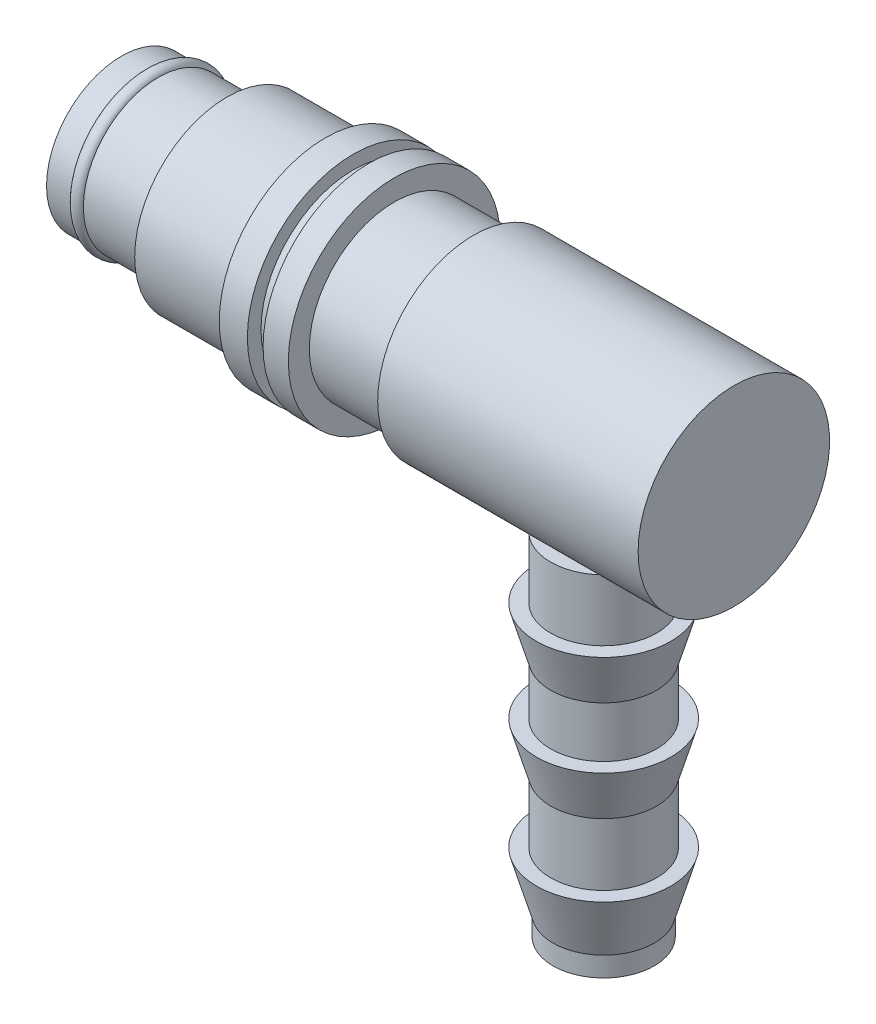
ISO-10303-21;
HEADER;
FILE_DESCRIPTION(('STEP AP214'),'2;1');
FILE_NAME('part.step','',(''),(''),'','','');
FILE_SCHEMA(('AUTOMOTIVE_DESIGN { 1 0 10303 214 1 1 1 1 }'));
ENDSEC;
DATA;
#1=APPLICATION_CONTEXT('core data for automotive mechanical design processes');
#2=APPLICATION_PROTOCOL_DEFINITION('international standard','automotive_design',2000,#1);
#3=PRODUCT_CONTEXT('',#1,'mechanical');
#4=PRODUCT('Part','Part','',(#3));
#5=PRODUCT_RELATED_PRODUCT_CATEGORY('part','',(#4));
#6=PRODUCT_DEFINITION_FORMATION('','',#4);
#7=PRODUCT_DEFINITION_CONTEXT('part definition',#1,'design');
#8=PRODUCT_DEFINITION('design','',#6,#7);
#9=PRODUCT_DEFINITION_SHAPE('','',#8);
#10=(LENGTH_UNIT() NAMED_UNIT(*) SI_UNIT(.MILLI.,.METRE.));
#11=(NAMED_UNIT(*) PLANE_ANGLE_UNIT() SI_UNIT($,.RADIAN.));
#12=(NAMED_UNIT(*) SI_UNIT($,.STERADIAN.) SOLID_ANGLE_UNIT());
#13=UNCERTAINTY_MEASURE_WITH_UNIT(LENGTH_MEASURE(1.E-05),#10,'distance_accuracy_value','');
#14=(GEOMETRIC_REPRESENTATION_CONTEXT(3) GLOBAL_UNCERTAINTY_ASSIGNED_CONTEXT((#13)) GLOBAL_UNIT_ASSIGNED_CONTEXT((#10,
#11,#12)) REPRESENTATION_CONTEXT('',''));
#15=CARTESIAN_POINT('',(0.,0.,0.));
#16=DIRECTION('',(0.,0.,1.));
#17=DIRECTION('',(1.,0.,0.));
#18=AXIS2_PLACEMENT_3D('',#15,#16,#17);
#19=CARTESIAN_POINT('',(0.,0.,0.));
#20=DIRECTION('',(-1.,0.,0.));
#21=DIRECTION('',(0.,0.,1.));
#22=AXIS2_PLACEMENT_3D('',#19,#20,#21);
#23=CYLINDRICAL_SURFACE('',#22,7.07715720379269);
#24=CARTESIAN_POINT('',(0.,0.,0.));
#25=DIRECTION('',(-1.,0.,0.));
#26=DIRECTION('',(0.,0.,1.));
#27=AXIS2_PLACEMENT_3D('',#24,#25,#26);
#28=CIRCLE('',#27,7.07715720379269);
#29=CARTESIAN_POINT('',(0.,0.,7.07715720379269));
#30=VERTEX_POINT('',#29);
#31=EDGE_CURVE('P0_E61',#30,#30,#28,.T.);
#32=ORIENTED_EDGE('',*,*,#31,.F.);
#33=EDGE_LOOP('',(#32));
#34=FACE_BOUND('',#33,.T.);
#35=CARTESIAN_POINT('',(2.30534147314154,0.,0.));
#36=DIRECTION('',(-1.,0.,0.));
#37=DIRECTION('',(0.,0.,1.));
#38=AXIS2_PLACEMENT_3D('',#35,#36,#37);
#39=CIRCLE('',#38,7.07715720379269);
#40=CARTESIAN_POINT('',(2.30534147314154,0.,7.07715720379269));
#41=VERTEX_POINT('',#40);
#42=EDGE_CURVE('P0_E9',#41,#41,#39,.T.);
#43=ORIENTED_EDGE('',*,*,#42,.T.);
#44=EDGE_LOOP('',(#43));
#45=FACE_BOUND('',#44,.T.);
#46=ADVANCED_FACE('P0_F14',(#34,#45),#23,.T.);
#47=CARTESIAN_POINT('',(2.88991003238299,0.,0.));
#48=DIRECTION('',(-1.,0.,0.));
#49=DIRECTION('',(0.,0.,1.));
#50=AXIS2_PLACEMENT_3D('',#47,#48,#49);
#51=TOROIDAL_SURFACE('',#50,6.84108143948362,0.630438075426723);
#52=ORIENTED_EDGE('',*,*,#42,.F.);
#53=EDGE_LOOP('',(#52));
#54=FACE_BOUND('',#53,.T.);
#55=CARTESIAN_POINT('',(3.47447859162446,0.,0.));
#56=DIRECTION('',(-1.,0.,0.));
#57=DIRECTION('',(0.,0.,1.));
#58=AXIS2_PLACEMENT_3D('',#55,#56,#57);
#59=CIRCLE('',#58,7.07715720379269);
#60=CARTESIAN_POINT('',(3.47447859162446,0.,7.07715720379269));
#61=VERTEX_POINT('',#60);
#62=EDGE_CURVE('P0_E20',#61,#61,#59,.T.);
#63=ORIENTED_EDGE('',*,*,#62,.T.);
#64=EDGE_LOOP('',(#63));
#65=FACE_BOUND('',#64,.T.);
#66=ADVANCED_FACE('P0_F111',(#54,#65),#51,.T.);
#67=CARTESIAN_POINT('',(0.,0.,0.));
#68=DIRECTION('',(-1.,0.,0.));
#69=DIRECTION('',(0.,0.,1.));
#70=AXIS2_PLACEMENT_3D('',#67,#68,#69);
#71=CYLINDRICAL_SURFACE('',#70,7.07715720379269);
#72=ORIENTED_EDGE('',*,*,#62,.F.);
#73=EDGE_LOOP('',(#72));
#74=FACE_BOUND('',#73,.T.);
#75=CARTESIAN_POINT('',(9.95613472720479,0.,0.));
#76=DIRECTION('',(-1.,0.,0.));
#77=DIRECTION('',(0.,0.,1.));
#78=AXIS2_PLACEMENT_3D('',#75,#76,#77);
#79=CIRCLE('',#78,7.07715720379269);
#80=CARTESIAN_POINT('',(9.95613472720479,0.,7.07715720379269));
#81=VERTEX_POINT('',#80);
#82=EDGE_CURVE('P0_E24',#81,#81,#79,.T.);
#83=ORIENTED_EDGE('',*,*,#82,.T.);
#84=EDGE_LOOP('',(#83));
#85=FACE_BOUND('',#84,.T.);
#86=ADVANCED_FACE('P0_F117',(#74,#85),#71,.T.);
#87=CARTESIAN_POINT('',(9.95613472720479,7.07715720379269,0.));
#88=DIRECTION('',(1.,0.,0.));
#89=DIRECTION('',(0.,0.,-1.));
#90=AXIS2_PLACEMENT_3D('',#87,#88,#89);
#91=PLANE('',#90);
#92=ORIENTED_EDGE('',*,*,#82,.F.);
#93=EDGE_LOOP('',(#92));
#94=FACE_BOUND('',#93,.T.);
#95=CARTESIAN_POINT('',(9.95613472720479,0.,0.));
#96=DIRECTION('',(-1.,0.,0.));
#97=DIRECTION('',(0.,0.,1.));
#98=AXIS2_PLACEMENT_3D('',#95,#96,#97);
#99=CIRCLE('',#98,8.71439657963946);
#100=CARTESIAN_POINT('',(9.95613472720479,0.,8.71439657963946));
#101=VERTEX_POINT('',#100);
#102=EDGE_CURVE('P0_E28',#101,#101,#99,.T.);
#103=ORIENTED_EDGE('',*,*,#102,.T.);
#104=EDGE_LOOP('',(#103));
#105=FACE_BOUND('',#104,.T.);
#106=ADVANCED_FACE('P0_F123',(#94,#105),#91,.F.);
#107=CARTESIAN_POINT('',(0.,0.,0.));
#108=DIRECTION('',(-1.,0.,0.));
#109=DIRECTION('',(0.,0.,1.));
#110=AXIS2_PLACEMENT_3D('',#107,#108,#109);
#111=CYLINDRICAL_SURFACE('',#110,8.71439657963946);
#112=ORIENTED_EDGE('',*,*,#102,.F.);
#113=EDGE_LOOP('',(#112));
#114=FACE_BOUND('',#113,.T.);
#115=CARTESIAN_POINT('',(19.2212798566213,0.,0.));
#116=DIRECTION('',(-1.,0.,0.));
#117=DIRECTION('',(0.,0.,1.));
#118=AXIS2_PLACEMENT_3D('',#115,#116,#117);
#119=CIRCLE('',#118,8.71439657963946);
#120=CARTESIAN_POINT('',(19.2212798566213,0.,8.71439657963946));
#121=VERTEX_POINT('',#120);
#122=EDGE_CURVE('P0_E33',#121,#121,#119,.T.);
#123=ORIENTED_EDGE('',*,*,#122,.T.);
#124=EDGE_LOOP('',(#123));
#125=FACE_BOUND('',#124,.T.);
#126=ADVANCED_FACE('P0_F129',(#114,#125),#111,.T.);
#127=CARTESIAN_POINT('',(19.2212798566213,8.71439657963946,0.));
#128=DIRECTION('',(1.,0.,0.));
#129=DIRECTION('',(0.,0.,-1.));
#130=AXIS2_PLACEMENT_3D('',#127,#128,#129);
#131=PLANE('',#130);
#132=ORIENTED_EDGE('',*,*,#122,.F.);
#133=EDGE_LOOP('',(#132));
#134=FACE_BOUND('',#133,.T.);
#135=CARTESIAN_POINT('',(19.2212798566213,0.,0.));
#136=DIRECTION('',(-1.,0.,0.));
#137=DIRECTION('',(0.,0.,1.));
#138=AXIS2_PLACEMENT_3D('',#135,#136,#137);
#139=CIRCLE('',#138,10.);
#140=CARTESIAN_POINT('',(19.2212798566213,0.,10.));
#141=VERTEX_POINT('',#140);
#142=EDGE_CURVE('P0_E36',#141,#141,#139,.T.);
#143=ORIENTED_EDGE('',*,*,#142,.T.);
#144=EDGE_LOOP('',(#143));
#145=FACE_BOUND('',#144,.T.);
#146=ADVANCED_FACE('P0_F133',(#134,#145),#131,.F.);
#147=CARTESIAN_POINT('',(0.,0.,0.));
#148=DIRECTION('',(-1.,0.,0.));
#149=DIRECTION('',(0.,0.,1.));
#150=AXIS2_PLACEMENT_3D('',#147,#148,#149);
#151=CYLINDRICAL_SURFACE('',#150,10.);
#152=ORIENTED_EDGE('',*,*,#142,.F.);
#153=EDGE_LOOP('',(#152));
#154=FACE_BOUND('',#153,.T.);
#155=CARTESIAN_POINT('',(21.8743217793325,0.,0.));
#156=DIRECTION('',(-1.,0.,0.));
#157=DIRECTION('',(0.,0.,1.));
#158=AXIS2_PLACEMENT_3D('',#155,#156,#157);
#159=CIRCLE('',#158,10.);
#160=CARTESIAN_POINT('',(21.8743217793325,0.,10.));
#161=VERTEX_POINT('',#160);
#162=EDGE_CURVE('P0_E39',#161,#161,#159,.T.);
#163=ORIENTED_EDGE('',*,*,#162,.T.);
#164=EDGE_LOOP('',(#163));
#165=FACE_BOUND('',#164,.T.);
#166=ADVANCED_FACE('P0_F137',(#154,#165),#151,.T.);
#167=CARTESIAN_POINT('',(21.8743217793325,10.,0.));
#168=DIRECTION('',(-1.,0.,0.));
#169=DIRECTION('',(0.,0.,1.));
#170=AXIS2_PLACEMENT_3D('',#167,#168,#169);
#171=PLANE('',#170);
#172=ORIENTED_EDGE('',*,*,#162,.F.);
#173=EDGE_LOOP('',(#172));
#174=FACE_BOUND('',#173,.T.);
#175=CARTESIAN_POINT('',(21.8743217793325,0.,0.));
#176=DIRECTION('',(-1.,0.,0.));
#177=DIRECTION('',(0.,0.,1.));
#178=AXIS2_PLACEMENT_3D('',#175,#176,#177);
#179=CIRCLE('',#178,8.71439657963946);
#180=CARTESIAN_POINT('',(21.8743217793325,0.,8.71439657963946));
#181=VERTEX_POINT('',#180);
#182=EDGE_CURVE('P0_E42',#181,#181,#179,.T.);
#183=ORIENTED_EDGE('',*,*,#182,.T.);
#184=EDGE_LOOP('',(#183));
#185=FACE_BOUND('',#184,.T.);
#186=ADVANCED_FACE('P0_F141',(#174,#185),#171,.F.);
#187=CARTESIAN_POINT('',(0.,0.,0.));
#188=DIRECTION('',(-1.,0.,0.));
#189=DIRECTION('',(0.,0.,1.));
#190=AXIS2_PLACEMENT_3D('',#187,#188,#189);
#191=CYLINDRICAL_SURFACE('',#190,8.71439657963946);
#192=ORIENTED_EDGE('',*,*,#182,.F.);
#193=EDGE_LOOP('',(#192));
#194=FACE_BOUND('',#193,.T.);
#195=CARTESIAN_POINT('',(23.3582265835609,0.,0.));
#196=DIRECTION('',(-1.,0.,0.));
#197=DIRECTION('',(0.,0.,1.));
#198=AXIS2_PLACEMENT_3D('',#195,#196,#197);
#199=CIRCLE('',#198,8.71439657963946);
#200=CARTESIAN_POINT('',(23.3582265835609,0.,8.71439657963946));
#201=VERTEX_POINT('',#200);
#202=EDGE_CURVE('P0_E45',#201,#201,#199,.T.);
#203=ORIENTED_EDGE('',*,*,#202,.T.);
#204=EDGE_LOOP('',(#203));
#205=FACE_BOUND('',#204,.T.);
#206=ADVANCED_FACE('P0_F145',(#194,#205),#191,.T.);
#207=CARTESIAN_POINT('',(23.3582265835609,8.71439657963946,0.));
#208=DIRECTION('',(1.,0.,0.));
#209=DIRECTION('',(0.,0.,-1.));
#210=AXIS2_PLACEMENT_3D('',#207,#208,#209);
#211=PLANE('',#210);
#212=ORIENTED_EDGE('',*,*,#202,.F.);
#213=EDGE_LOOP('',(#212));
#214=FACE_BOUND('',#213,.T.);
#215=CARTESIAN_POINT('',(23.3582265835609,0.,0.));
#216=DIRECTION('',(-1.,0.,0.));
#217=DIRECTION('',(0.,0.,1.));
#218=AXIS2_PLACEMENT_3D('',#215,#216,#217);
#219=CIRCLE('',#218,10.);
#220=CARTESIAN_POINT('',(23.3582265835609,0.,10.));
#221=VERTEX_POINT('',#220);
#222=EDGE_CURVE('P0_E48',#221,#221,#219,.T.);
#223=ORIENTED_EDGE('',*,*,#222,.T.);
#224=EDGE_LOOP('',(#223));
#225=FACE_BOUND('',#224,.T.);
#226=ADVANCED_FACE('P0_F149',(#214,#225),#211,.F.);
#227=CARTESIAN_POINT('',(0.,0.,0.));
#228=DIRECTION('',(-1.,0.,0.));
#229=DIRECTION('',(0.,0.,1.));
#230=AXIS2_PLACEMENT_3D('',#227,#228,#229);
#231=CYLINDRICAL_SURFACE('',#230,10.);
#232=ORIENTED_EDGE('',*,*,#222,.F.);
#233=EDGE_LOOP('',(#232));
#234=FACE_BOUND('',#233,.T.);
#235=CARTESIAN_POINT('',(25.7414676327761,0.,0.));
#236=DIRECTION('',(-1.,0.,0.));
#237=DIRECTION('',(0.,0.,1.));
#238=AXIS2_PLACEMENT_3D('',#235,#236,#237);
#239=CIRCLE('',#238,10.);
#240=CARTESIAN_POINT('',(25.7414676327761,0.,10.));
#241=VERTEX_POINT('',#240);
#242=EDGE_CURVE('P0_E51',#241,#241,#239,.T.);
#243=ORIENTED_EDGE('',*,*,#242,.T.);
#244=EDGE_LOOP('',(#243));
#245=FACE_BOUND('',#244,.T.);
#246=ADVANCED_FACE('P0_F153',(#234,#245),#231,.T.);
#247=CARTESIAN_POINT('',(25.7414676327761,10.,0.));
#248=DIRECTION('',(-1.,0.,0.));
#249=DIRECTION('',(0.,0.,1.));
#250=AXIS2_PLACEMENT_3D('',#247,#248,#249);
#251=PLANE('',#250);
#252=ORIENTED_EDGE('',*,*,#242,.F.);
#253=EDGE_LOOP('',(#252));
#254=FACE_BOUND('',#253,.T.);
#255=CARTESIAN_POINT('',(25.7414676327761,0.,0.));
#256=DIRECTION('',(-1.,0.,0.));
#257=DIRECTION('',(0.,0.,1.));
#258=AXIS2_PLACEMENT_3D('',#255,#256,#257);
#259=CIRCLE('',#258,8.0214602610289);
#260=CARTESIAN_POINT('',(25.7414676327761,0.,8.0214602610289));
#261=VERTEX_POINT('',#260);
#262=EDGE_CURVE('P0_E54',#261,#261,#259,.T.);
#263=ORIENTED_EDGE('',*,*,#262,.T.);
#264=EDGE_LOOP('',(#263));
#265=FACE_BOUND('',#264,.T.);
#266=ADVANCED_FACE('P0_F157',(#254,#265),#251,.F.);
#267=CARTESIAN_POINT('',(0.,0.,0.));
#268=DIRECTION('',(-1.,0.,0.));
#269=DIRECTION('',(0.,0.,1.));
#270=AXIS2_PLACEMENT_3D('',#267,#268,#269);
#271=CYLINDRICAL_SURFACE('',#270,8.0214602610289);
#272=ORIENTED_EDGE('',*,*,#262,.F.);
#273=EDGE_LOOP('',(#272));
#274=FACE_BOUND('',#273,.T.);
#275=CARTESIAN_POINT('',(33.2113990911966,0.,0.));
#276=DIRECTION('',(-1.,0.,0.));
#277=DIRECTION('',(0.,0.,1.));
#278=AXIS2_PLACEMENT_3D('',#275,#276,#277);
#279=CIRCLE('',#278,8.0214602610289);
#280=CARTESIAN_POINT('',(33.2113990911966,0.,8.0214602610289));
#281=VERTEX_POINT('',#280);
#282=EDGE_CURVE('P0_E58',#281,#281,#279,.T.);
#283=ORIENTED_EDGE('',*,*,#282,.T.);
#284=EDGE_LOOP('',(#283));
#285=FACE_BOUND('',#284,.T.);
#286=ADVANCED_FACE('P0_F101',(#274,#285),#271,.T.);
#287=CARTESIAN_POINT('',(0.,0.,0.));
#288=DIRECTION('',(-1.,0.,0.));
#289=DIRECTION('',(0.,0.,1.));
#290=AXIS2_PLACEMENT_3D('',#287,#288,#289);
#291=CYLINDRICAL_SURFACE('',#290,2.67040960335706);
#292=CARTESIAN_POINT('',(33.2113990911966,0.,0.));
#293=DIRECTION('',(-1.,0.,0.));
#294=DIRECTION('',(0.,0.,1.));
#295=AXIS2_PLACEMENT_3D('',#292,#293,#294);
#296=CIRCLE('',#295,2.67040960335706);
#297=CARTESIAN_POINT('',(33.2113990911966,0.,2.67040960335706));
#298=VERTEX_POINT('',#297);
#299=EDGE_CURVE('P0_E57',#298,#298,#296,.T.);
#300=ORIENTED_EDGE('',*,*,#299,.F.);
#301=EDGE_LOOP('',(#300));
#302=FACE_BOUND('',#301,.T.);
#303=CARTESIAN_POINT('',(0.,0.,0.));
#304=DIRECTION('',(-1.,0.,0.));
#305=DIRECTION('',(0.,0.,1.));
#306=AXIS2_PLACEMENT_3D('',#303,#304,#305);
#307=CIRCLE('',#306,2.67040960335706);
#308=CARTESIAN_POINT('',(0.,0.,2.67040960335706));
#309=VERTEX_POINT('',#308);
#310=EDGE_CURVE('P0_E65',#309,#309,#307,.T.);
#311=ORIENTED_EDGE('',*,*,#310,.T.);
#312=EDGE_LOOP('',(#311));
#313=FACE_BOUND('',#312,.T.);
#314=ADVANCED_FACE('P0_F97',(#302,#313),#291,.F.);
#315=CARTESIAN_POINT('',(0.,2.67040960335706,0.));
#316=DIRECTION('',(1.,0.,0.));
#317=DIRECTION('',(0.,0.,-1.));
#318=AXIS2_PLACEMENT_3D('',#315,#316,#317);
#319=PLANE('',#318);
#320=ORIENTED_EDGE('',*,*,#310,.F.);
#321=EDGE_LOOP('',(#320));
#322=FACE_BOUND('',#321,.T.);
#323=ORIENTED_EDGE('',*,*,#31,.T.);
#324=EDGE_LOOP('',(#323));
#325=FACE_BOUND('',#324,.T.);
#326=ADVANCED_FACE('P0_F100',(#322,#325),#319,.F.);
#327=CARTESIAN_POINT('',(51.4339968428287,0.,0.));
#328=DIRECTION('',(1.,0.,0.));
#329=DIRECTION('',(0.,0.,-1.));
#330=AXIS2_PLACEMENT_3D('',#327,#328,#329);
#331=PLANE('',#330);
#332=CARTESIAN_POINT('',(51.4339968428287,0.,0.));
#333=DIRECTION('',(-1.,0.,0.));
#334=DIRECTION('',(0.,0.,1.));
#335=AXIS2_PLACEMENT_3D('',#332,#333,#334);
#336=CIRCLE('',#335,2.5);
#337=CARTESIAN_POINT('',(51.4339968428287,0.,2.5));
#338=VERTEX_POINT('',#337);
#339=EDGE_CURVE('P0_E78',#338,#338,#336,.T.);
#340=ORIENTED_EDGE('',*,*,#339,.T.);
#341=EDGE_LOOP('',(#340));
#342=FACE_BOUND('',#341,.T.);
#343=ADVANCED_FACE('P0_F82',(#342),#331,.F.);
#344=CARTESIAN_POINT('',(33.2113990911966,0.,0.));
#345=DIRECTION('',(-1.,0.,0.));
#346=DIRECTION('',(0.,0.,1.));
#347=AXIS2_PLACEMENT_3D('',#344,#345,#346);
#348=CYLINDRICAL_SURFACE('',#347,2.5);
#349=ORIENTED_EDGE('',*,*,#339,.F.);
#350=EDGE_LOOP('',(#349));
#351=FACE_BOUND('',#350,.T.);
#352=CARTESIAN_POINT('',(33.2113990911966,0.,0.));
#353=DIRECTION('',(-1.,0.,0.));
#354=DIRECTION('',(0.,0.,1.));
#355=AXIS2_PLACEMENT_3D('',#352,#353,#354);
#356=CIRCLE('',#355,2.5);
#357=CARTESIAN_POINT('',(33.2113990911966,0.,2.5));
#358=VERTEX_POINT('',#357);
#359=EDGE_CURVE('P0_E62',#358,#358,#356,.T.);
#360=ORIENTED_EDGE('',*,*,#359,.T.);
#361=EDGE_LOOP('',(#360));
#362=FACE_BOUND('',#361,.T.);
#363=ADVANCED_FACE('P0_F84',(#351,#362),#348,.F.);
#364=CARTESIAN_POINT('',(33.2113990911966,2.5,0.));
#365=DIRECTION('',(1.,0.,0.));
#366=DIRECTION('',(0.,0.,-1.));
#367=AXIS2_PLACEMENT_3D('',#364,#365,#366);
#368=PLANE('',#367);
#369=ORIENTED_EDGE('',*,*,#359,.F.);
#370=EDGE_LOOP('',(#369));
#371=FACE_BOUND('',#370,.T.);
#372=ORIENTED_EDGE('',*,*,#299,.T.);
#373=EDGE_LOOP('',(#372));
#374=FACE_BOUND('',#373,.T.);
#375=ADVANCED_FACE('P0_F87',(#371,#374),#368,.F.);
#376=ORIENTED_EDGE('',*,*,#282,.F.);
#377=EDGE_LOOP('',(#376));
#378=FACE_BOUND('',#377,.T.);
#379=CARTESIAN_POINT('',(33.2113990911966,0.,0.));
#380=DIRECTION('',(-1.,0.,0.));
#381=DIRECTION('',(0.,0.,1.));
#382=AXIS2_PLACEMENT_3D('',#379,#380,#381);
#383=CIRCLE('',#382,9.03773569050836);
#384=CARTESIAN_POINT('',(33.2113990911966,0.,9.03773569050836));
#385=VERTEX_POINT('',#384);
#386=EDGE_CURVE('P0_E72',#385,#385,#383,.T.);
#387=ORIENTED_EDGE('',*,*,#386,.T.);
#388=EDGE_LOOP('',(#387));
#389=FACE_BOUND('',#388,.T.);
#390=ADVANCED_FACE('P0_F93',(#378,#389),#368,.F.);
#391=CARTESIAN_POINT('',(33.2113990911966,0.,0.));
#392=DIRECTION('',(-1.,0.,0.));
#393=DIRECTION('',(0.,0.,1.));
#394=AXIS2_PLACEMENT_3D('',#391,#392,#393);
#395=CYLINDRICAL_SURFACE('',#394,9.03773569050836);
#396=ORIENTED_EDGE('',*,*,#386,.F.);
#397=EDGE_LOOP('',(#396));
#398=FACE_BOUND('',#397,.T.);
#399=CARTESIAN_POINT('',(57.7886009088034,0.,0.));
#400=DIRECTION('',(-1.,0.,0.));
#401=DIRECTION('',(0.,0.,1.));
#402=AXIS2_PLACEMENT_3D('',#399,#400,#401);
#403=CIRCLE('',#402,9.03773569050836);
#404=CARTESIAN_POINT('',(57.7886009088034,0.,9.03773569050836));
#405=VERTEX_POINT('',#404);
#406=EDGE_CURVE('P0_E75',#405,#405,#403,.T.);
#407=ORIENTED_EDGE('',*,*,#406,.T.);
#408=EDGE_LOOP('',(#407));
#409=FACE_BOUND('',#408,.T.);
#410=ADVANCED_FACE('P0_F166',(#398,#409),#395,.T.);
#411=CARTESIAN_POINT('',(57.7886009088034,2.5,0.));
#412=DIRECTION('',(-1.,0.,0.));
#413=DIRECTION('',(0.,0.,1.));
#414=AXIS2_PLACEMENT_3D('',#411,#412,#413);
#415=PLANE('',#414);
#416=ORIENTED_EDGE('',*,*,#406,.F.);
#417=EDGE_LOOP('',(#416));
#418=FACE_BOUND('',#417,.T.);
#419=ADVANCED_FACE('P0_F170',(#418),#415,.F.);
#420=CLOSED_SHELL('',(#46,#66,#86,#106,#126,#146,#166,#186,#206,#226,#246,#266,#286,#314,#326,
#343,#363,#375,#390,#410,#419));
#421=MANIFOLD_SOLID_BREP('P0_B1',#420);
#422=CARTESIAN_POINT('',(45.5,-9.03773569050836,0.));
#423=DIRECTION('',(0.,-1.,0.));
#424=DIRECTION('',(0.,0.,-1.));
#425=AXIS2_PLACEMENT_3D('',#422,#423,#424);
#426=PLANE('',#425);
#427=CARTESIAN_POINT('',(45.5,-9.03773569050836,0.));
#428=DIRECTION('',(0.,1.,0.));
#429=DIRECTION('',(0.,0.,1.));
#430=AXIS2_PLACEMENT_3D('',#427,#428,#429);
#431=CIRCLE('',#430,5.);
#432=CARTESIAN_POINT('',(45.5,-9.03773569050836,5.));
#433=VERTEX_POINT('',#432);
#434=EDGE_CURVE('P1_E9',#433,#433,#431,.T.);
#435=ORIENTED_EDGE('',*,*,#434,.T.);
#436=EDGE_LOOP('',(#435));
#437=FACE_BOUND('',#436,.T.);
#438=ADVANCED_FACE('P1_F14',(#437),#426,.F.);
#439=CARTESIAN_POINT('',(45.5,-9.03773569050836,0.));
#440=DIRECTION('',(0.,1.,0.));
#441=DIRECTION('',(0.,0.,1.));
#442=AXIS2_PLACEMENT_3D('',#439,#440,#441);
#443=CYLINDRICAL_SURFACE('',#442,5.);
#444=ORIENTED_EDGE('',*,*,#434,.F.);
#445=EDGE_LOOP('',(#444));
#446=FACE_BOUND('',#445,.T.);
#447=CARTESIAN_POINT('',(45.5,-14.8419196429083,0.));
#448=DIRECTION('',(0.,1.,0.));
#449=DIRECTION('',(0.,0.,1.));
#450=AXIS2_PLACEMENT_3D('',#447,#448,#449);
#451=CIRCLE('',#450,5.);
#452=CARTESIAN_POINT('',(45.5,-14.8419196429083,5.));
#453=VERTEX_POINT('',#452);
#454=EDGE_CURVE('P1_E20',#453,#453,#451,.T.);
#455=ORIENTED_EDGE('',*,*,#454,.T.);
#456=EDGE_LOOP('',(#455));
#457=FACE_BOUND('',#456,.T.);
#458=ADVANCED_FACE('P1_F69',(#446,#457),#443,.T.);
#459=CARTESIAN_POINT('',(50.5,-14.8419196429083,0.));
#460=DIRECTION('',(0.,-1.,0.));
#461=DIRECTION('',(0.,0.,-1.));
#462=AXIS2_PLACEMENT_3D('',#459,#460,#461);
#463=PLANE('',#462);
#464=ORIENTED_EDGE('',*,*,#454,.F.);
#465=EDGE_LOOP('',(#464));
#466=FACE_BOUND('',#465,.T.);
#467=CARTESIAN_POINT('',(45.5,-14.8419196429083,0.));
#468=DIRECTION('',(0.,1.,0.));
#469=DIRECTION('',(0.,0.,1.));
#470=AXIS2_PLACEMENT_3D('',#467,#468,#469);
#471=CIRCLE('',#470,6.3401623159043);
#472=CARTESIAN_POINT('',(45.5,-14.8419196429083,6.3401623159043));
#473=VERTEX_POINT('',#472);
#474=EDGE_CURVE('P1_E24',#473,#473,#471,.T.);
#475=ORIENTED_EDGE('',*,*,#474,.T.);
#476=EDGE_LOOP('',(#475));
#477=FACE_BOUND('',#476,.T.);
#478=ADVANCED_FACE('P1_F74',(#466,#477),#463,.F.);
#479=CARTESIAN_POINT('',(45.5,-19.5131972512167,0.));
#480=DIRECTION('',(0.,1.,0.));
#481=DIRECTION('',(0.,0.,1.));
#482=AXIS2_PLACEMENT_3D('',#479,#480,#481);
#483=CONICAL_SURFACE('',#482,5.,0.279390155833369);
#484=ORIENTED_EDGE('',*,*,#474,.F.);
#485=EDGE_LOOP('',(#484));
#486=FACE_BOUND('',#485,.T.);
#487=CARTESIAN_POINT('',(45.5,-19.5131972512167,0.));
#488=DIRECTION('',(0.,1.,0.));
#489=DIRECTION('',(0.,0.,1.));
#490=AXIS2_PLACEMENT_3D('',#487,#488,#489);
#491=CIRCLE('',#490,5.);
#492=CARTESIAN_POINT('',(45.5,-19.5131972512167,5.));
#493=VERTEX_POINT('',#492);
#494=EDGE_CURVE('P1_E28',#493,#493,#491,.T.);
#495=ORIENTED_EDGE('',*,*,#494,.T.);
#496=EDGE_LOOP('',(#495));
#497=FACE_BOUND('',#496,.T.);
#498=ADVANCED_FACE('P1_F80',(#486,#497),#483,.T.);
#499=CARTESIAN_POINT('',(45.5,-9.03773569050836,0.));
#500=DIRECTION('',(0.,1.,0.));
#501=DIRECTION('',(0.,0.,1.));
#502=AXIS2_PLACEMENT_3D('',#499,#500,#501);
#503=CYLINDRICAL_SURFACE('',#502,5.);
#504=ORIENTED_EDGE('',*,*,#494,.F.);
#505=EDGE_LOOP('',(#504));
#506=FACE_BOUND('',#505,.T.);
#507=CARTESIAN_POINT('',(45.5,-24.3042512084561,0.));
#508=DIRECTION('',(0.,1.,0.));
#509=DIRECTION('',(0.,0.,1.));
#510=AXIS2_PLACEMENT_3D('',#507,#508,#509);
#511=CIRCLE('',#510,5.);
#512=CARTESIAN_POINT('',(45.5,-24.3042512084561,5.));
#513=VERTEX_POINT('',#512);
#514=EDGE_CURVE('P1_E33',#513,#513,#511,.T.);
#515=ORIENTED_EDGE('',*,*,#514,.T.);
#516=EDGE_LOOP('',(#515));
#517=FACE_BOUND('',#516,.T.);
#518=ADVANCED_FACE('P1_F86',(#506,#517),#503,.T.);
#519=CARTESIAN_POINT('',(50.5,-24.3042512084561,0.));
#520=DIRECTION('',(0.,-1.,0.));
#521=DIRECTION('',(0.,0.,-1.));
#522=AXIS2_PLACEMENT_3D('',#519,#520,#521);
#523=PLANE('',#522);
#524=ORIENTED_EDGE('',*,*,#514,.F.);
#525=EDGE_LOOP('',(#524));
#526=FACE_BOUND('',#525,.T.);
#527=CARTESIAN_POINT('',(45.5,-24.3042512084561,0.));
#528=DIRECTION('',(0.,1.,0.));
#529=DIRECTION('',(0.,0.,1.));
#530=AXIS2_PLACEMENT_3D('',#527,#528,#529);
#531=CIRCLE('',#530,6.3401623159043);
#532=CARTESIAN_POINT('',(45.5,-24.3042512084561,6.3401623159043));
#533=VERTEX_POINT('',#532);
#534=EDGE_CURVE('P1_E36',#533,#533,#531,.T.);
#535=ORIENTED_EDGE('',*,*,#534,.T.);
#536=EDGE_LOOP('',(#535));
#537=FACE_BOUND('',#536,.T.);
#538=ADVANCED_FACE('P1_F90',(#526,#537),#523,.F.);
#539=CARTESIAN_POINT('',(45.5,-28.9755288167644,0.));
#540=DIRECTION('',(0.,1.,0.));
#541=DIRECTION('',(0.,0.,1.));
#542=AXIS2_PLACEMENT_3D('',#539,#540,#541);
#543=CONICAL_SURFACE('',#542,5.,0.279390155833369);
#544=ORIENTED_EDGE('',*,*,#534,.F.);
#545=EDGE_LOOP('',(#544));
#546=FACE_BOUND('',#545,.T.);
#547=CARTESIAN_POINT('',(45.5,-28.9755288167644,0.));
#548=DIRECTION('',(0.,1.,0.));
#549=DIRECTION('',(0.,0.,1.));
#550=AXIS2_PLACEMENT_3D('',#547,#548,#549);
#551=CIRCLE('',#550,5.);
#552=CARTESIAN_POINT('',(45.5,-28.9755288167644,5.));
#553=VERTEX_POINT('',#552);
#554=EDGE_CURVE('P1_E39',#553,#553,#551,.T.);
#555=ORIENTED_EDGE('',*,*,#554,.T.);
#556=EDGE_LOOP('',(#555));
#557=FACE_BOUND('',#556,.T.);
#558=ADVANCED_FACE('P1_F94',(#546,#557),#543,.T.);
#559=CARTESIAN_POINT('',(45.5,-9.03773569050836,0.));
#560=DIRECTION('',(0.,1.,0.));
#561=DIRECTION('',(0.,0.,1.));
#562=AXIS2_PLACEMENT_3D('',#559,#560,#561);
#563=CYLINDRICAL_SURFACE('',#562,5.);
#564=ORIENTED_EDGE('',*,*,#554,.F.);
#565=EDGE_LOOP('',(#564));
#566=FACE_BOUND('',#565,.T.);
#567=CARTESIAN_POINT('',(45.5,-34.8445699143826,0.));
#568=DIRECTION('',(0.,1.,0.));
#569=DIRECTION('',(0.,0.,1.));
#570=AXIS2_PLACEMENT_3D('',#567,#568,#569);
#571=CIRCLE('',#570,5.);
#572=CARTESIAN_POINT('',(45.5,-34.8445699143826,5.));
#573=VERTEX_POINT('',#572);
#574=EDGE_CURVE('P1_E42',#573,#573,#571,.T.);
#575=ORIENTED_EDGE('',*,*,#574,.T.);
#576=EDGE_LOOP('',(#575));
#577=FACE_BOUND('',#576,.T.);
#578=ADVANCED_FACE('P1_F98',(#566,#577),#563,.T.);
#579=CARTESIAN_POINT('',(50.5,-34.8445699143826,0.));
#580=DIRECTION('',(0.,-1.,0.));
#581=DIRECTION('',(0.,0.,-1.));
#582=AXIS2_PLACEMENT_3D('',#579,#580,#581);
#583=PLANE('',#582);
#584=ORIENTED_EDGE('',*,*,#574,.F.);
#585=EDGE_LOOP('',(#584));
#586=FACE_BOUND('',#585,.T.);
#587=CARTESIAN_POINT('',(45.5,-34.8445699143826,0.));
#588=DIRECTION('',(0.,1.,0.));
#589=DIRECTION('',(0.,0.,1.));
#590=AXIS2_PLACEMENT_3D('',#587,#588,#589);
#591=CIRCLE('',#590,6.3401623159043);
#592=CARTESIAN_POINT('',(45.5,-34.8445699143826,6.3401623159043));
#593=VERTEX_POINT('',#592);
#594=EDGE_CURVE('P1_E45',#593,#593,#591,.T.);
#595=ORIENTED_EDGE('',*,*,#594,.T.);
#596=EDGE_LOOP('',(#595));
#597=FACE_BOUND('',#596,.T.);
#598=ADVANCED_FACE('P1_F102',(#586,#597),#583,.F.);
#599=CARTESIAN_POINT('',(45.5,-40.2845233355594,0.));
#600=DIRECTION('',(0.,1.,0.));
#601=DIRECTION('',(0.,0.,1.));
#602=AXIS2_PLACEMENT_3D('',#599,#600,#601);
#603=CONICAL_SURFACE('',#602,4.77947139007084,0.279390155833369);
#604=ORIENTED_EDGE('',*,*,#594,.F.);
#605=EDGE_LOOP('',(#604));
#606=FACE_BOUND('',#605,.T.);
#607=CARTESIAN_POINT('',(45.5,-40.2845233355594,0.));
#608=DIRECTION('',(0.,1.,0.));
#609=DIRECTION('',(0.,0.,1.));
#610=AXIS2_PLACEMENT_3D('',#607,#608,#609);
#611=CIRCLE('',#610,4.77947139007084);
#612=CARTESIAN_POINT('',(45.5,-40.2845233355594,4.77947139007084));
#613=VERTEX_POINT('',#612);
#614=EDGE_CURVE('P1_E48',#613,#613,#611,.T.);
#615=ORIENTED_EDGE('',*,*,#614,.T.);
#616=EDGE_LOOP('',(#615));
#617=FACE_BOUND('',#616,.T.);
#618=ADVANCED_FACE('P1_F65',(#606,#617),#603,.T.);
#619=CARTESIAN_POINT('',(45.5,-9.03773569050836,0.));
#620=DIRECTION('',(0.,1.,0.));
#621=DIRECTION('',(0.,0.,1.));
#622=AXIS2_PLACEMENT_3D('',#619,#620,#621);
#623=CYLINDRICAL_SURFACE('',#622,4.77947139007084);
#624=ORIENTED_EDGE('',*,*,#614,.F.);
#625=EDGE_LOOP('',(#624));
#626=FACE_BOUND('',#625,.T.);
#627=CARTESIAN_POINT('',(45.5,-42.1509271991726,0.));
#628=DIRECTION('',(0.,1.,0.));
#629=DIRECTION('',(0.,0.,1.));
#630=AXIS2_PLACEMENT_3D('',#627,#628,#629);
#631=CIRCLE('',#630,4.77947139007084);
#632=CARTESIAN_POINT('',(45.5,-42.1509271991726,4.77947139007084));
#633=VERTEX_POINT('',#632);
#634=EDGE_CURVE('P1_E51',#633,#633,#631,.T.);
#635=ORIENTED_EDGE('',*,*,#634,.T.);
#636=EDGE_LOOP('',(#635));
#637=FACE_BOUND('',#636,.T.);
#638=ADVANCED_FACE('P1_F55',(#626,#637),#623,.T.);
#639=CARTESIAN_POINT('',(50.2794713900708,-42.1509271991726,0.));
#640=DIRECTION('',(0.,1.,0.));
#641=DIRECTION('',(0.,0.,1.));
#642=AXIS2_PLACEMENT_3D('',#639,#640,#641);
#643=PLANE('',#642);
#644=ORIENTED_EDGE('',*,*,#634,.F.);
#645=EDGE_LOOP('',(#644));
#646=FACE_BOUND('',#645,.T.);
#647=ADVANCED_FACE('P1_F57',(#646),#643,.F.);
#648=CLOSED_SHELL('',(#438,#458,#478,#498,#518,#538,#558,#578,#598,#618,#638,#647));
#649=MANIFOLD_SOLID_BREP('P1_B1',#648);
#650=ADVANCED_BREP_SHAPE_REPRESENTATION('',(#18,#421,#649),#14);
#651=SHAPE_DEFINITION_REPRESENTATION(#9,#650);
ENDSEC;
END-ISO-10303-21;
